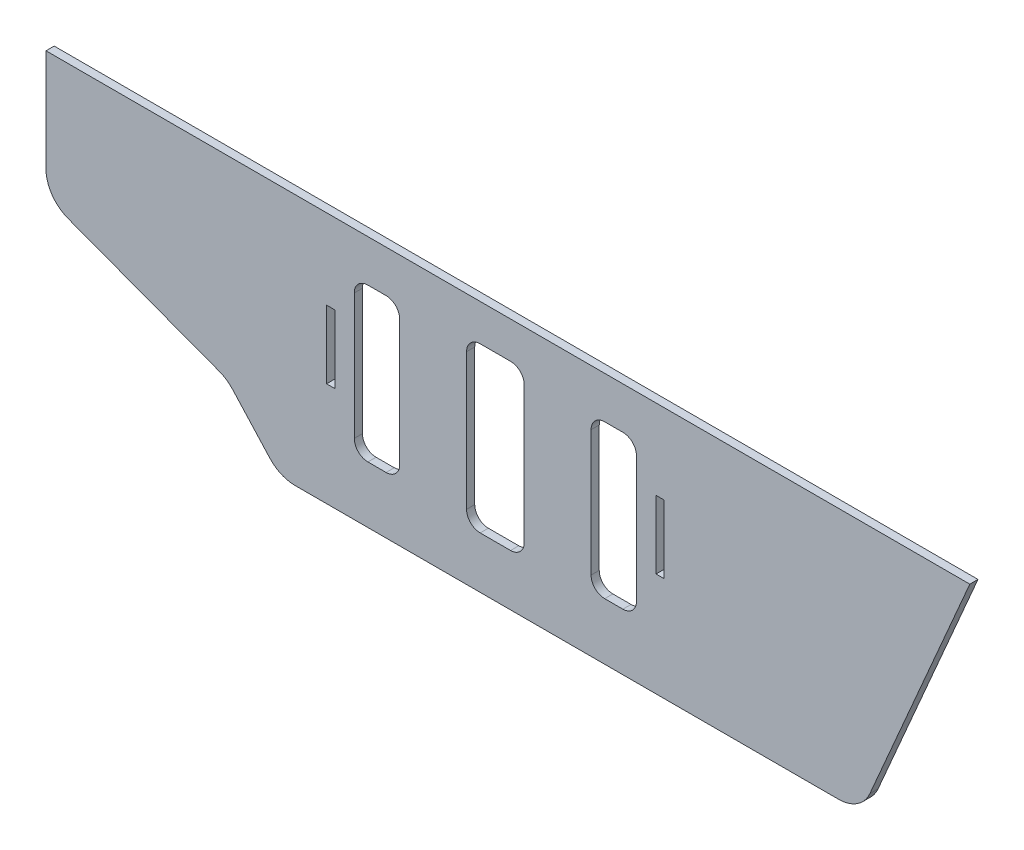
ISO-10303-21;
HEADER;
FILE_DESCRIPTION(('STEP AP214'),'2;1');
FILE_NAME('part.step','',(''),(''),'','','');
FILE_SCHEMA(('AUTOMOTIVE_DESIGN { 1 0 10303 214 1 1 1 1 }'));
ENDSEC;
DATA;
#1=APPLICATION_CONTEXT('core data for automotive mechanical design processes');
#2=APPLICATION_PROTOCOL_DEFINITION('international standard','automotive_design',2000,#1);
#3=PRODUCT_CONTEXT('',#1,'mechanical');
#4=PRODUCT('Part','Part','',(#3));
#5=PRODUCT_RELATED_PRODUCT_CATEGORY('part','',(#4));
#6=PRODUCT_DEFINITION_FORMATION('','',#4);
#7=PRODUCT_DEFINITION_CONTEXT('part definition',#1,'design');
#8=PRODUCT_DEFINITION('design','',#6,#7);
#9=PRODUCT_DEFINITION_SHAPE('','',#8);
#10=(LENGTH_UNIT() NAMED_UNIT(*) SI_UNIT(.MILLI.,.METRE.));
#11=(NAMED_UNIT(*) PLANE_ANGLE_UNIT() SI_UNIT($,.RADIAN.));
#12=(NAMED_UNIT(*) SI_UNIT($,.STERADIAN.) SOLID_ANGLE_UNIT());
#13=UNCERTAINTY_MEASURE_WITH_UNIT(LENGTH_MEASURE(1.E-05),#10,'distance_accuracy_value','');
#14=(GEOMETRIC_REPRESENTATION_CONTEXT(3) GLOBAL_UNCERTAINTY_ASSIGNED_CONTEXT((#13)) GLOBAL_UNIT_ASSIGNED_CONTEXT((#10,
#11,#12)) REPRESENTATION_CONTEXT('',''));
#15=CARTESIAN_POINT('',(0.,0.,0.));
#16=DIRECTION('',(0.,0.,1.));
#17=DIRECTION('',(1.,0.,0.));
#18=AXIS2_PLACEMENT_3D('',#15,#16,#17);
#19=CARTESIAN_POINT('',(-108.88532555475,19.4699268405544,1.524));
#20=DIRECTION('',(0.,0.,-1.));
#21=DIRECTION('',(-1.,0.,0.));
#22=AXIS2_PLACEMENT_3D('',#19,#20,#21);
#23=PLANE('',#22);
#24=CARTESIAN_POINT('',(-7.69915683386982,4.71718740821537,1.524));
#25=DIRECTION('',(0.,0.,1.));
#26=DIRECTION('',(-1.,0.,0.));
#27=AXIS2_PLACEMENT_3D('',#24,#25,#26);
#28=CIRCLE('',#27,2.54);
#29=CARTESIAN_POINT('',(-7.69915683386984,2.17718740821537,1.524));
#30=VERTEX_POINT('',#29);
#31=CARTESIAN_POINT('',(-5.15915683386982,4.71718740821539,1.524));
#32=VERTEX_POINT('',#31);
#33=EDGE_CURVE('E370',#30,#32,#28,.T.);
#34=ORIENTED_EDGE('',*,*,#33,.F.);
#35=DIRECTION('',(1.,0.,0.));
#36=VECTOR('',#35,1.);
#37=CARTESIAN_POINT('',(-7.69915683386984,2.17718740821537,1.524));
#38=LINE('',#37,#36);
#39=CARTESIAN_POINT('',(-11.0925705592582,2.17718740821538,1.524));
#40=VERTEX_POINT('',#39);
#41=EDGE_CURVE('E386',#40,#30,#38,.T.);
#42=ORIENTED_EDGE('',*,*,#41,.F.);
#43=CARTESIAN_POINT('',(-11.0925705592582,4.71718740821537,1.524));
#44=DIRECTION('',(0.,0.,1.));
#45=DIRECTION('',(-1.,0.,0.));
#46=AXIS2_PLACEMENT_3D('',#43,#44,#45);
#47=CIRCLE('',#46,2.54);
#48=CARTESIAN_POINT('',(-13.6325705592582,4.71718740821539,1.524));
#49=VERTEX_POINT('',#48);
#50=EDGE_CURVE('E383',#49,#40,#47,.T.);
#51=ORIENTED_EDGE('',*,*,#50,.F.);
#52=DIRECTION('',(0.,-1.,0.));
#53=VECTOR('',#52,1.);
#54=CARTESIAN_POINT('',(-13.6325705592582,28.1845217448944,1.524));
#55=LINE('',#54,#53);
#56=CARTESIAN_POINT('',(-13.6325705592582,28.1845217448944,1.524));
#57=VERTEX_POINT('',#56);
#58=EDGE_CURVE('E381',#57,#49,#55,.T.);
#59=ORIENTED_EDGE('',*,*,#58,.F.);
#60=CARTESIAN_POINT('',(-11.0925705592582,28.1845217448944,1.524));
#61=DIRECTION('',(0.,0.,1.));
#62=DIRECTION('',(1.,0.,0.));
#63=AXIS2_PLACEMENT_3D('',#60,#61,#62);
#64=CIRCLE('',#63,2.54);
#65=CARTESIAN_POINT('',(-11.0925705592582,30.7245217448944,1.524));
#66=VERTEX_POINT('',#65);
#67=EDGE_CURVE('E379',#66,#57,#64,.T.);
#68=ORIENTED_EDGE('',*,*,#67,.F.);
#69=DIRECTION('',(-1.,0.,0.));
#70=VECTOR('',#69,1.);
#71=CARTESIAN_POINT('',(-7.69915683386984,30.7245217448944,1.524));
#72=LINE('',#71,#70);
#73=CARTESIAN_POINT('',(-7.69915683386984,30.7245217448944,1.524));
#74=VERTEX_POINT('',#73);
#75=EDGE_CURVE('E377',#74,#66,#72,.T.);
#76=ORIENTED_EDGE('',*,*,#75,.F.);
#77=CARTESIAN_POINT('',(-7.69915683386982,28.1845217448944,1.524));
#78=DIRECTION('',(0.,0.,1.));
#79=DIRECTION('',(-1.,0.,0.));
#80=AXIS2_PLACEMENT_3D('',#77,#78,#79);
#81=CIRCLE('',#80,2.54);
#82=CARTESIAN_POINT('',(-5.15915683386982,28.1845217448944,1.524));
#83=VERTEX_POINT('',#82);
#84=EDGE_CURVE('E375',#83,#74,#81,.T.);
#85=ORIENTED_EDGE('',*,*,#84,.F.);
#86=DIRECTION('',(0.,1.,0.));
#87=VECTOR('',#86,1.);
#88=CARTESIAN_POINT('',(-5.15915683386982,28.1845217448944,1.524));
#89=LINE('',#88,#87);
#90=EDGE_CURVE('E372',#32,#83,#89,.T.);
#91=ORIENTED_EDGE('',*,*,#90,.F.);
#92=EDGE_LOOP('',(#34,#42,#51,#59,#68,#76,#85,#91));
#93=FACE_BOUND('',#92,.T.);
#94=DIRECTION('',(0.,-1.,0.));
#95=VECTOR('',#94,1.);
#96=CARTESIAN_POINT('',(-1.524,10.9420975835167,1.524));
#97=LINE('',#96,#95);
#98=CARTESIAN_POINT('',(-1.524,23.6420975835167,1.524));
#99=VERTEX_POINT('',#98);
#100=CARTESIAN_POINT('',(-1.524,10.9420975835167,1.524));
#101=VERTEX_POINT('',#100);
#102=EDGE_CURVE('E488',#99,#101,#97,.T.);
#103=ORIENTED_EDGE('',*,*,#102,.F.);
#104=DIRECTION('',(-1.,0.,0.));
#105=VECTOR('',#104,1.);
#106=CARTESIAN_POINT('',(-1.524,23.6420975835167,1.524));
#107=LINE('',#106,#105);
#108=CARTESIAN_POINT('',(0.,23.6420975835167,1.524));
#109=VERTEX_POINT('',#108);
#110=EDGE_CURVE('E496',#109,#99,#107,.T.);
#111=ORIENTED_EDGE('',*,*,#110,.F.);
#112=DIRECTION('',(0.,1.,0.));
#113=VECTOR('',#112,1.);
#114=CARTESIAN_POINT('',(0.,10.9420975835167,1.524));
#115=LINE('',#114,#113);
#116=CARTESIAN_POINT('',(0.,10.9420975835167,1.524));
#117=VERTEX_POINT('',#116);
#118=EDGE_CURVE('E493',#117,#109,#115,.T.);
#119=ORIENTED_EDGE('',*,*,#118,.F.);
#120=DIRECTION('',(1.,0.,0.));
#121=VECTOR('',#120,1.);
#122=CARTESIAN_POINT('',(-1.524,10.9420975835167,1.524));
#123=LINE('',#122,#121);
#124=EDGE_CURVE('E490',#101,#117,#123,.T.);
#125=ORIENTED_EDGE('',*,*,#124,.F.);
#126=EDGE_LOOP('',(#103,#111,#119,#125));
#127=FACE_BOUND('',#126,.T.);
#128=DIRECTION('',(0.,-1.,0.));
#129=VECTOR('',#128,1.);
#130=CARTESIAN_POINT('',(-115.23532555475,38.5530338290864,1.524));
#131=LINE('',#130,#129);
#132=CARTESIAN_POINT('',(-115.23532555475,38.5530338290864,1.524));
#133=VERTEX_POINT('',#132);
#134=CARTESIAN_POINT('',(-115.23532555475,19.4699268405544,1.524));
#135=VERTEX_POINT('',#134);
#136=EDGE_CURVE('E550',#133,#135,#131,.T.);
#137=ORIENTED_EDGE('',*,*,#136,.T.);
#138=CARTESIAN_POINT('',(-108.88532555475,19.4699268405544,1.524));
#139=DIRECTION('',(0.,0.,1.));
#140=DIRECTION('',(-1.,0.,0.));
#141=AXIS2_PLACEMENT_3D('',#138,#139,#140);
#142=CIRCLE('',#141,6.35);
#143=CARTESIAN_POINT('',(-111.115025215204,13.5242612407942,1.524));
#144=VERTEX_POINT('',#143);
#145=EDGE_CURVE('E553',#135,#144,#142,.T.);
#146=ORIENTED_EDGE('',*,*,#145,.T.);
#147=DIRECTION('',(0.936325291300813,-0.351133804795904,0.));
#148=VECTOR('',#147,1.);
#149=CARTESIAN_POINT('',(-111.115025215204,13.5242612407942,1.524));
#150=LINE('',#149,#148);
#151=CARTESIAN_POINT('',(-82.9262828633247,2.95312699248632,1.524));
#152=VERTEX_POINT('',#151);
#153=EDGE_CURVE('E556',#144,#152,#150,.T.);
#154=ORIENTED_EDGE('',*,*,#153,.T.);
#155=CARTESIAN_POINT('',(-85.1559825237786,-2.99253860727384,1.524));
#156=DIRECTION('',(0.,0.,-1.));
#157=DIRECTION('',(-1.,0.,0.));
#158=AXIS2_PLACEMENT_3D('',#155,#156,#157);
#159=CIRCLE('',#158,6.35);
#160=CARTESIAN_POINT('',(-80.4611769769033,1.28312518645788,1.524));
#161=VERTEX_POINT('',#160);
#162=EDGE_CURVE('E558',#152,#161,#159,.T.);
#163=ORIENTED_EDGE('',*,*,#162,.T.);
#164=DIRECTION('',(0.673332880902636,-0.739339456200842,0.));
#165=VECTOR('',#164,1.);
#166=CARTESIAN_POINT('',(-80.4611769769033,1.28312518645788,1.524));
#167=LINE('',#166,#165);
#168=CARTESIAN_POINT('',(-73.5187677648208,-6.33984585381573,1.524));
#169=VERTEX_POINT('',#168);
#170=EDGE_CURVE('E560',#161,#169,#167,.T.);
#171=ORIENTED_EDGE('',*,*,#170,.T.);
#172=CARTESIAN_POINT('',(-68.8239622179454,-2.06418206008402,1.524));
#173=DIRECTION('',(0.,0.,1.));
#174=DIRECTION('',(1.,0.,0.));
#175=AXIS2_PLACEMENT_3D('',#172,#173,#174);
#176=CIRCLE('',#175,6.35);
#177=CARTESIAN_POINT('',(-68.8239622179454,-8.41418206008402,1.524));
#178=VERTEX_POINT('',#177);
#179=EDGE_CURVE('E562',#169,#178,#176,.T.);
#180=ORIENTED_EDGE('',*,*,#179,.T.);
#181=DIRECTION('',(1.,0.,0.));
#182=VECTOR('',#181,1.);
#183=CARTESIAN_POINT('',(-68.8239622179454,-8.41418206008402,1.524));
#184=LINE('',#183,#182);
#185=CARTESIAN_POINT('',(32.5063760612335,-8.41418206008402,1.524));
#186=VERTEX_POINT('',#185);
#187=EDGE_CURVE('E564',#178,#186,#184,.T.);
#188=ORIENTED_EDGE('',*,*,#187,.T.);
#189=CARTESIAN_POINT('',(32.5063760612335,-2.06418206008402,1.524));
#190=DIRECTION('',(0.,0.,1.));
#191=DIRECTION('',(-1.,0.,0.));
#192=AXIS2_PLACEMENT_3D('',#189,#190,#191);
#193=CIRCLE('',#192,6.35);
#194=CARTESIAN_POINT('',(38.3357665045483,-4.58225812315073,1.524));
#195=VERTEX_POINT('',#194);
#196=EDGE_CURVE('E566',#186,#195,#193,.T.);
#197=ORIENTED_EDGE('',*,*,#196,.T.);
#198=DIRECTION('',(0.396547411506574,0.918014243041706,0.));
#199=VECTOR('',#198,1.);
#200=CARTESIAN_POINT('',(56.9685802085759,38.5530338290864,1.524));
#201=LINE('',#200,#199);
#202=CARTESIAN_POINT('',(56.9685802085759,38.5530338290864,1.524));
#203=VERTEX_POINT('',#202);
#204=EDGE_CURVE('E568',#195,#203,#201,.T.);
#205=ORIENTED_EDGE('',*,*,#204,.T.);
#206=DIRECTION('',(-1.,0.,0.));
#207=VECTOR('',#206,1.);
#208=CARTESIAN_POINT('',(-115.23532555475,38.5530338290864,1.524));
#209=LINE('',#208,#207);
#210=EDGE_CURVE('E570',#203,#133,#209,.T.);
#211=ORIENTED_EDGE('',*,*,#210,.T.);
#212=EDGE_LOOP('',(#137,#146,#154,#163,#171,#180,#188,#197,#205,#211));
#213=FACE_BOUND('',#212,.T.);
#214=DIRECTION('',(0.,-1.,0.));
#215=VECTOR('',#214,1.);
#216=CARTESIAN_POINT('',(-62.9329472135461,10.9420975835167,1.524));
#217=LINE('',#216,#215);
#218=CARTESIAN_POINT('',(-62.9329472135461,23.6420975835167,1.524));
#219=VERTEX_POINT('',#218);
#220=CARTESIAN_POINT('',(-62.9329472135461,10.9420975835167,1.524));
#221=VERTEX_POINT('',#220);
#222=EDGE_CURVE('E519',#219,#221,#217,.T.);
#223=ORIENTED_EDGE('',*,*,#222,.F.);
#224=DIRECTION('',(-1.,0.,0.));
#225=VECTOR('',#224,1.);
#226=CARTESIAN_POINT('',(-62.9329472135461,23.6420975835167,1.524));
#227=LINE('',#226,#225);
#228=CARTESIAN_POINT('',(-61.4089472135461,23.6420975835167,1.524));
#229=VERTEX_POINT('',#228);
#230=EDGE_CURVE('E527',#229,#219,#227,.T.);
#231=ORIENTED_EDGE('',*,*,#230,.F.);
#232=DIRECTION('',(0.,1.,0.));
#233=VECTOR('',#232,1.);
#234=CARTESIAN_POINT('',(-61.4089472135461,10.9420975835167,1.524));
#235=LINE('',#234,#233);
#236=CARTESIAN_POINT('',(-61.4089472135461,10.9420975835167,1.524));
#237=VERTEX_POINT('',#236);
#238=EDGE_CURVE('E524',#237,#229,#235,.T.);
#239=ORIENTED_EDGE('',*,*,#238,.F.);
#240=DIRECTION('',(1.,0.,0.));
#241=VECTOR('',#240,1.);
#242=CARTESIAN_POINT('',(-62.9329472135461,10.9420975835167,1.524));
#243=LINE('',#242,#241);
#244=EDGE_CURVE('E521',#221,#237,#243,.T.);
#245=ORIENTED_EDGE('',*,*,#244,.F.);
#246=EDGE_LOOP('',(#223,#231,#239,#245));
#247=FACE_BOUND('',#246,.T.);
#248=CARTESIAN_POINT('',(-55.2337903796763,28.1845217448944,1.524));
#249=DIRECTION('',(0.,0.,1.));
#250=DIRECTION('',(1.,0.,0.));
#251=AXIS2_PLACEMENT_3D('',#248,#249,#250);
#252=CIRCLE('',#251,2.54);
#253=CARTESIAN_POINT('',(-55.2337903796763,30.7245217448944,1.524));
#254=VERTEX_POINT('',#253);
#255=CARTESIAN_POINT('',(-57.7737903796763,28.1845217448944,1.524));
#256=VERTEX_POINT('',#255);
#257=EDGE_CURVE('E429',#254,#256,#252,.T.);
#258=ORIENTED_EDGE('',*,*,#257,.F.);
#259=DIRECTION('',(-1.,0.,0.));
#260=VECTOR('',#259,1.);
#261=CARTESIAN_POINT('',(-55.2337903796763,30.7245217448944,1.524));
#262=LINE('',#261,#260);
#263=CARTESIAN_POINT('',(-51.8403766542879,30.7245217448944,1.524));
#264=VERTEX_POINT('',#263);
#265=EDGE_CURVE('E445',#264,#254,#262,.T.);
#266=ORIENTED_EDGE('',*,*,#265,.F.);
#267=CARTESIAN_POINT('',(-51.8403766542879,28.1845217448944,1.524));
#268=DIRECTION('',(0.,0.,1.));
#269=DIRECTION('',(-1.,0.,0.));
#270=AXIS2_PLACEMENT_3D('',#267,#268,#269);
#271=CIRCLE('',#270,2.54);
#272=CARTESIAN_POINT('',(-49.3003766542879,28.1845217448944,1.524));
#273=VERTEX_POINT('',#272);
#274=EDGE_CURVE('E442',#273,#264,#271,.T.);
#275=ORIENTED_EDGE('',*,*,#274,.F.);
#276=DIRECTION('',(0.,1.,0.));
#277=VECTOR('',#276,1.);
#278=CARTESIAN_POINT('',(-49.3003766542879,28.1845217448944,1.524));
#279=LINE('',#278,#277);
#280=CARTESIAN_POINT('',(-49.3003766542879,4.71718740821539,1.524));
#281=VERTEX_POINT('',#280);
#282=EDGE_CURVE('E440',#281,#273,#279,.T.);
#283=ORIENTED_EDGE('',*,*,#282,.F.);
#284=CARTESIAN_POINT('',(-51.8403766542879,4.71718740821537,1.524));
#285=DIRECTION('',(0.,0.,1.));
#286=DIRECTION('',(1.,0.,0.));
#287=AXIS2_PLACEMENT_3D('',#284,#285,#286);
#288=CIRCLE('',#287,2.54);
#289=CARTESIAN_POINT('',(-51.8403766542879,2.17718740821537,1.524));
#290=VERTEX_POINT('',#289);
#291=EDGE_CURVE('E438',#290,#281,#288,.T.);
#292=ORIENTED_EDGE('',*,*,#291,.F.);
#293=DIRECTION('',(1.,0.,0.));
#294=VECTOR('',#293,1.);
#295=CARTESIAN_POINT('',(-55.2337903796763,2.17718740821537,1.524));
#296=LINE('',#295,#294);
#297=CARTESIAN_POINT('',(-55.2337903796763,2.17718740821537,1.524));
#298=VERTEX_POINT('',#297);
#299=EDGE_CURVE('E436',#298,#290,#296,.T.);
#300=ORIENTED_EDGE('',*,*,#299,.F.);
#301=CARTESIAN_POINT('',(-55.2337903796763,4.71718740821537,1.524));
#302=DIRECTION('',(0.,0.,1.));
#303=DIRECTION('',(1.,0.,0.));
#304=AXIS2_PLACEMENT_3D('',#301,#302,#303);
#305=CIRCLE('',#304,2.54);
#306=CARTESIAN_POINT('',(-57.7737903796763,4.71718740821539,1.524));
#307=VERTEX_POINT('',#306);
#308=EDGE_CURVE('E434',#307,#298,#305,.T.);
#309=ORIENTED_EDGE('',*,*,#308,.F.);
#310=DIRECTION('',(0.,-1.,0.));
#311=VECTOR('',#310,1.);
#312=CARTESIAN_POINT('',(-57.7737903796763,28.1845217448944,1.524));
#313=LINE('',#312,#311);
#314=EDGE_CURVE('E431',#256,#307,#313,.T.);
#315=ORIENTED_EDGE('',*,*,#314,.F.);
#316=EDGE_LOOP('',(#258,#266,#275,#283,#292,#300,#309,#315));
#317=FACE_BOUND('',#316,.T.);
#318=CARTESIAN_POINT('',(-34.3028356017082,3.72575810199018,1.524));
#319=DIRECTION('',(0.,0.,1.));
#320=DIRECTION('',(-1.,0.,0.));
#321=AXIS2_PLACEMENT_3D('',#318,#319,#320);
#322=CIRCLE('',#321,2.54);
#323=CARTESIAN_POINT('',(-36.8428356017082,3.72575810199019,1.524));
#324=VERTEX_POINT('',#323);
#325=CARTESIAN_POINT('',(-34.3028356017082,1.18575810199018,1.524));
#326=VERTEX_POINT('',#325);
#327=EDGE_CURVE('E305',#324,#326,#322,.T.);
#328=ORIENTED_EDGE('',*,*,#327,.F.);
#329=DIRECTION('',(0.,-1.,0.));
#330=VECTOR('',#329,1.);
#331=CARTESIAN_POINT('',(-36.8428356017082,3.72575810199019,1.524));
#332=LINE('',#331,#330);
#333=CARTESIAN_POINT('',(-36.8428356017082,29.1759510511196,1.524));
#334=VERTEX_POINT('',#333);
#335=EDGE_CURVE('E338',#334,#324,#332,.T.);
#336=ORIENTED_EDGE('',*,*,#335,.F.);
#337=CARTESIAN_POINT('',(-34.3028356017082,29.1759510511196,1.524));
#338=DIRECTION('',(0.,0.,1.));
#339=DIRECTION('',(-1.,0.,0.));
#340=AXIS2_PLACEMENT_3D('',#337,#338,#339);
#341=CIRCLE('',#340,2.54);
#342=CARTESIAN_POINT('',(-34.3028356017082,31.7159510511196,1.524));
#343=VERTEX_POINT('',#342);
#344=EDGE_CURVE('E336',#343,#334,#341,.T.);
#345=ORIENTED_EDGE('',*,*,#344,.F.);
#346=DIRECTION('',(-1.,0.,0.));
#347=VECTOR('',#346,1.);
#348=CARTESIAN_POINT('',(-34.3028356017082,31.7159510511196,1.524));
#349=LINE('',#348,#347);
#350=CARTESIAN_POINT('',(-28.630111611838,31.7159510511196,1.524));
#351=VERTEX_POINT('',#350);
#352=EDGE_CURVE('E334',#351,#343,#349,.T.);
#353=ORIENTED_EDGE('',*,*,#352,.F.);
#354=CARTESIAN_POINT('',(-28.6301116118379,29.1759510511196,1.524));
#355=DIRECTION('',(0.,0.,1.));
#356=DIRECTION('',(-1.,0.,0.));
#357=AXIS2_PLACEMENT_3D('',#354,#355,#356);
#358=CIRCLE('',#357,2.54);
#359=CARTESIAN_POINT('',(-26.0901116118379,29.1759510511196,1.524));
#360=VERTEX_POINT('',#359);
#361=EDGE_CURVE('E332',#360,#351,#358,.T.);
#362=ORIENTED_EDGE('',*,*,#361,.F.);
#363=DIRECTION('',(0.,1.,0.));
#364=VECTOR('',#363,1.);
#365=CARTESIAN_POINT('',(-26.0901116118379,3.72575810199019,1.524));
#366=LINE('',#365,#364);
#367=CARTESIAN_POINT('',(-26.0901116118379,3.72575810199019,1.524));
#368=VERTEX_POINT('',#367);
#369=EDGE_CURVE('E328',#368,#360,#366,.T.);
#370=ORIENTED_EDGE('',*,*,#369,.F.);
#371=CARTESIAN_POINT('',(-28.6301116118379,3.72575810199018,1.524));
#372=DIRECTION('',(0.,0.,1.));
#373=DIRECTION('',(1.,0.,0.));
#374=AXIS2_PLACEMENT_3D('',#371,#372,#373);
#375=CIRCLE('',#374,2.54);
#376=CARTESIAN_POINT('',(-28.630111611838,1.18575810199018,1.524));
#377=VERTEX_POINT('',#376);
#378=EDGE_CURVE('E326',#377,#368,#375,.T.);
#379=ORIENTED_EDGE('',*,*,#378,.F.);
#380=DIRECTION('',(1.,0.,0.));
#381=VECTOR('',#380,1.);
#382=CARTESIAN_POINT('',(-34.3028356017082,1.18575810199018,1.524));
#383=LINE('',#382,#381);
#384=EDGE_CURVE('E313',#326,#377,#383,.T.);
#385=ORIENTED_EDGE('',*,*,#384,.F.);
#386=EDGE_LOOP('',(#328,#336,#345,#353,#362,#370,#379,#385));
#387=FACE_BOUND('',#386,.T.);
#388=ADVANCED_FACE('F36',(#93,#127,#213,#247,#317,#387),#23,.F.);
#389=CARTESIAN_POINT('',(-108.88532555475,19.4699268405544,0.));
#390=DIRECTION('',(0.,0.,-1.));
#391=DIRECTION('',(-1.,0.,0.));
#392=AXIS2_PLACEMENT_3D('',#389,#390,#391);
#393=PLANE('',#392);
#394=DIRECTION('',(1.,0.,0.));
#395=VECTOR('',#394,1.);
#396=CARTESIAN_POINT('',(-7.69915683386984,2.17718740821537,0.));
#397=LINE('',#396,#395);
#398=CARTESIAN_POINT('',(-11.0925705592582,2.17718740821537,0.));
#399=VERTEX_POINT('',#398);
#400=CARTESIAN_POINT('',(-7.69915683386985,2.17718740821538,0.));
#401=VERTEX_POINT('',#400);
#402=EDGE_CURVE('E373',#399,#401,#397,.T.);
#403=ORIENTED_EDGE('',*,*,#402,.T.);
#404=CARTESIAN_POINT('',(-7.69915683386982,4.71718740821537,0.));
#405=DIRECTION('',(0.,0.,1.));
#406=DIRECTION('',(-1.,0.,0.));
#407=AXIS2_PLACEMENT_3D('',#404,#405,#406);
#408=CIRCLE('',#407,2.54);
#409=CARTESIAN_POINT('',(-5.15915683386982,4.71718740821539,0.));
#410=VERTEX_POINT('',#409);
#411=EDGE_CURVE('E321',#401,#410,#408,.T.);
#412=ORIENTED_EDGE('',*,*,#411,.T.);
#413=DIRECTION('',(0.,1.,0.));
#414=VECTOR('',#413,1.);
#415=CARTESIAN_POINT('',(-5.15915683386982,28.1845217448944,0.));
#416=LINE('',#415,#414);
#417=CARTESIAN_POINT('',(-5.15915683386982,28.1845217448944,0.));
#418=VERTEX_POINT('',#417);
#419=EDGE_CURVE('E391',#410,#418,#416,.T.);
#420=ORIENTED_EDGE('',*,*,#419,.T.);
#421=CARTESIAN_POINT('',(-7.69915683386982,28.1845217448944,0.));
#422=DIRECTION('',(0.,0.,1.));
#423=DIRECTION('',(-1.,0.,0.));
#424=AXIS2_PLACEMENT_3D('',#421,#422,#423);
#425=CIRCLE('',#424,2.54);
#426=CARTESIAN_POINT('',(-7.69915683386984,30.7245217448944,0.));
#427=VERTEX_POINT('',#426);
#428=EDGE_CURVE('E394',#418,#427,#425,.T.);
#429=ORIENTED_EDGE('',*,*,#428,.T.);
#430=DIRECTION('',(-1.,0.,0.));
#431=VECTOR('',#430,1.);
#432=CARTESIAN_POINT('',(-7.69915683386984,30.7245217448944,0.));
#433=LINE('',#432,#431);
#434=CARTESIAN_POINT('',(-11.0925705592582,30.7245217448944,0.));
#435=VERTEX_POINT('',#434);
#436=EDGE_CURVE('E397',#427,#435,#433,.T.);
#437=ORIENTED_EDGE('',*,*,#436,.T.);
#438=CARTESIAN_POINT('',(-11.0925705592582,28.1845217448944,0.));
#439=DIRECTION('',(0.,0.,1.));
#440=DIRECTION('',(1.,0.,0.));
#441=AXIS2_PLACEMENT_3D('',#438,#439,#440);
#442=CIRCLE('',#441,2.54);
#443=CARTESIAN_POINT('',(-13.6325705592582,28.1845217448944,0.));
#444=VERTEX_POINT('',#443);
#445=EDGE_CURVE('E400',#435,#444,#442,.T.);
#446=ORIENTED_EDGE('',*,*,#445,.T.);
#447=DIRECTION('',(0.,-1.,0.));
#448=VECTOR('',#447,1.);
#449=CARTESIAN_POINT('',(-13.6325705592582,28.1845217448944,0.));
#450=LINE('',#449,#448);
#451=CARTESIAN_POINT('',(-13.6325705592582,4.71718740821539,0.));
#452=VERTEX_POINT('',#451);
#453=EDGE_CURVE('E403',#444,#452,#450,.T.);
#454=ORIENTED_EDGE('',*,*,#453,.T.);
#455=CARTESIAN_POINT('',(-11.0925705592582,4.71718740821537,0.));
#456=DIRECTION('',(0.,0.,1.));
#457=DIRECTION('',(-1.,0.,0.));
#458=AXIS2_PLACEMENT_3D('',#455,#456,#457);
#459=CIRCLE('',#458,2.54);
#460=EDGE_CURVE('E406',#452,#399,#459,.T.);
#461=ORIENTED_EDGE('',*,*,#460,.T.);
#462=EDGE_LOOP('',(#403,#412,#420,#429,#437,#446,#454,#461));
#463=FACE_BOUND('',#462,.T.);
#464=DIRECTION('',(-1.,0.,0.));
#465=VECTOR('',#464,1.);
#466=CARTESIAN_POINT('',(-1.524,23.6420975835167,0.));
#467=LINE('',#466,#465);
#468=CARTESIAN_POINT('',(0.,23.6420975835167,0.));
#469=VERTEX_POINT('',#468);
#470=CARTESIAN_POINT('',(-1.524,23.6420975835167,0.));
#471=VERTEX_POINT('',#470);
#472=EDGE_CURVE('E491',#469,#471,#467,.T.);
#473=ORIENTED_EDGE('',*,*,#472,.T.);
#474=DIRECTION('',(0.,-1.,0.));
#475=VECTOR('',#474,1.);
#476=CARTESIAN_POINT('',(-1.524,10.9420975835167,0.));
#477=LINE('',#476,#475);
#478=CARTESIAN_POINT('',(-1.524,10.9420975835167,0.));
#479=VERTEX_POINT('',#478);
#480=EDGE_CURVE('E487',#471,#479,#477,.T.);
#481=ORIENTED_EDGE('',*,*,#480,.T.);
#482=DIRECTION('',(1.,0.,0.));
#483=VECTOR('',#482,1.);
#484=CARTESIAN_POINT('',(-1.524,10.9420975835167,0.));
#485=LINE('',#484,#483);
#486=CARTESIAN_POINT('',(0.,10.9420975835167,0.));
#487=VERTEX_POINT('',#486);
#488=EDGE_CURVE('E501',#479,#487,#485,.T.);
#489=ORIENTED_EDGE('',*,*,#488,.T.);
#490=DIRECTION('',(0.,1.,0.));
#491=VECTOR('',#490,1.);
#492=CARTESIAN_POINT('',(0.,10.9420975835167,0.));
#493=LINE('',#492,#491);
#494=EDGE_CURVE('E504',#487,#469,#493,.T.);
#495=ORIENTED_EDGE('',*,*,#494,.T.);
#496=EDGE_LOOP('',(#473,#481,#489,#495));
#497=FACE_BOUND('',#496,.T.);
#498=DIRECTION('',(0.,-1.,0.));
#499=VECTOR('',#498,1.);
#500=CARTESIAN_POINT('',(-115.23532555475,38.5530338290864,0.));
#501=LINE('',#500,#499);
#502=CARTESIAN_POINT('',(-115.23532555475,38.5530338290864,0.));
#503=VERTEX_POINT('',#502);
#504=CARTESIAN_POINT('',(-115.23532555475,19.4699268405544,0.));
#505=VERTEX_POINT('',#504);
#506=EDGE_CURVE('E549',#503,#505,#501,.T.);
#507=ORIENTED_EDGE('',*,*,#506,.F.);
#508=DIRECTION('',(-1.,0.,0.));
#509=VECTOR('',#508,1.);
#510=CARTESIAN_POINT('',(-115.23532555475,38.5530338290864,0.));
#511=LINE('',#510,#509);
#512=CARTESIAN_POINT('',(56.9685802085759,38.5530338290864,0.));
#513=VERTEX_POINT('',#512);
#514=EDGE_CURVE('E554',#513,#503,#511,.T.);
#515=ORIENTED_EDGE('',*,*,#514,.F.);
#516=DIRECTION('',(0.396547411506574,0.918014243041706,0.));
#517=VECTOR('',#516,1.);
#518=CARTESIAN_POINT('',(56.9685802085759,38.5530338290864,0.));
#519=LINE('',#518,#517);
#520=CARTESIAN_POINT('',(38.3357665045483,-4.58225812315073,0.));
#521=VERTEX_POINT('',#520);
#522=EDGE_CURVE('E589',#521,#513,#519,.T.);
#523=ORIENTED_EDGE('',*,*,#522,.F.);
#524=CARTESIAN_POINT('',(32.5063760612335,-2.06418206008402,0.));
#525=DIRECTION('',(0.,0.,1.));
#526=DIRECTION('',(-1.,0.,0.));
#527=AXIS2_PLACEMENT_3D('',#524,#525,#526);
#528=CIRCLE('',#527,6.35);
#529=CARTESIAN_POINT('',(32.5063760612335,-8.41418206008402,0.));
#530=VERTEX_POINT('',#529);
#531=EDGE_CURVE('E587',#530,#521,#528,.T.);
#532=ORIENTED_EDGE('',*,*,#531,.F.);
#533=DIRECTION('',(1.,0.,0.));
#534=VECTOR('',#533,1.);
#535=CARTESIAN_POINT('',(-68.8239622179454,-8.41418206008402,0.));
#536=LINE('',#535,#534);
#537=CARTESIAN_POINT('',(-68.8239622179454,-8.41418206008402,0.));
#538=VERTEX_POINT('',#537);
#539=EDGE_CURVE('E585',#538,#530,#536,.T.);
#540=ORIENTED_EDGE('',*,*,#539,.F.);
#541=CARTESIAN_POINT('',(-68.8239622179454,-2.06418206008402,0.));
#542=DIRECTION('',(0.,0.,1.));
#543=DIRECTION('',(1.,0.,0.));
#544=AXIS2_PLACEMENT_3D('',#541,#542,#543);
#545=CIRCLE('',#544,6.35);
#546=CARTESIAN_POINT('',(-73.5187677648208,-6.33984585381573,0.));
#547=VERTEX_POINT('',#546);
#548=EDGE_CURVE('E583',#547,#538,#545,.T.);
#549=ORIENTED_EDGE('',*,*,#548,.F.);
#550=DIRECTION('',(0.673332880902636,-0.739339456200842,0.));
#551=VECTOR('',#550,1.);
#552=CARTESIAN_POINT('',(-80.4611769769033,1.28312518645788,0.));
#553=LINE('',#552,#551);
#554=CARTESIAN_POINT('',(-80.4611769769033,1.28312518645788,0.));
#555=VERTEX_POINT('',#554);
#556=EDGE_CURVE('E581',#555,#547,#553,.T.);
#557=ORIENTED_EDGE('',*,*,#556,.F.);
#558=CARTESIAN_POINT('',(-85.1559825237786,-2.99253860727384,0.));
#559=DIRECTION('',(0.,0.,-1.));
#560=DIRECTION('',(-1.,0.,0.));
#561=AXIS2_PLACEMENT_3D('',#558,#559,#560);
#562=CIRCLE('',#561,6.35);
#563=CARTESIAN_POINT('',(-82.9262828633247,2.95312699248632,0.));
#564=VERTEX_POINT('',#563);
#565=EDGE_CURVE('E579',#564,#555,#562,.T.);
#566=ORIENTED_EDGE('',*,*,#565,.F.);
#567=DIRECTION('',(0.936325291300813,-0.351133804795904,0.));
#568=VECTOR('',#567,1.);
#569=CARTESIAN_POINT('',(-111.115025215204,13.5242612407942,0.));
#570=LINE('',#569,#568);
#571=CARTESIAN_POINT('',(-111.115025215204,13.5242612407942,0.));
#572=VERTEX_POINT('',#571);
#573=EDGE_CURVE('E577',#572,#564,#570,.T.);
#574=ORIENTED_EDGE('',*,*,#573,.F.);
#575=CARTESIAN_POINT('',(-108.88532555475,19.4699268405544,0.));
#576=DIRECTION('',(0.,0.,1.));
#577=DIRECTION('',(-1.,0.,0.));
#578=AXIS2_PLACEMENT_3D('',#575,#576,#577);
#579=CIRCLE('',#578,6.35);
#580=EDGE_CURVE('E575',#505,#572,#579,.T.);
#581=ORIENTED_EDGE('',*,*,#580,.F.);
#582=EDGE_LOOP('',(#507,#515,#523,#532,#540,#549,#557,#566,#574,#581));
#583=FACE_BOUND('',#582,.T.);
#584=DIRECTION('',(-1.,0.,0.));
#585=VECTOR('',#584,1.);
#586=CARTESIAN_POINT('',(-62.9329472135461,23.6420975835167,0.));
#587=LINE('',#586,#585);
#588=CARTESIAN_POINT('',(-61.4089472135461,23.6420975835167,0.));
#589=VERTEX_POINT('',#588);
#590=CARTESIAN_POINT('',(-62.9329472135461,23.6420975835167,0.));
#591=VERTEX_POINT('',#590);
#592=EDGE_CURVE('E522',#589,#591,#587,.T.);
#593=ORIENTED_EDGE('',*,*,#592,.T.);
#594=DIRECTION('',(0.,-1.,0.));
#595=VECTOR('',#594,1.);
#596=CARTESIAN_POINT('',(-62.9329472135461,10.9420975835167,0.));
#597=LINE('',#596,#595);
#598=CARTESIAN_POINT('',(-62.9329472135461,10.9420975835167,0.));
#599=VERTEX_POINT('',#598);
#600=EDGE_CURVE('E518',#591,#599,#597,.T.);
#601=ORIENTED_EDGE('',*,*,#600,.T.);
#602=DIRECTION('',(1.,0.,0.));
#603=VECTOR('',#602,1.);
#604=CARTESIAN_POINT('',(-62.9329472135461,10.9420975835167,0.));
#605=LINE('',#604,#603);
#606=CARTESIAN_POINT('',(-61.4089472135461,10.9420975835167,0.));
#607=VERTEX_POINT('',#606);
#608=EDGE_CURVE('E532',#599,#607,#605,.T.);
#609=ORIENTED_EDGE('',*,*,#608,.T.);
#610=DIRECTION('',(0.,1.,0.));
#611=VECTOR('',#610,1.);
#612=CARTESIAN_POINT('',(-61.4089472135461,10.9420975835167,0.));
#613=LINE('',#612,#611);
#614=EDGE_CURVE('E535',#607,#589,#613,.T.);
#615=ORIENTED_EDGE('',*,*,#614,.T.);
#616=EDGE_LOOP('',(#593,#601,#609,#615));
#617=FACE_BOUND('',#616,.T.);
#618=DIRECTION('',(-1.,0.,0.));
#619=VECTOR('',#618,1.);
#620=CARTESIAN_POINT('',(-55.2337903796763,30.7245217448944,0.));
#621=LINE('',#620,#619);
#622=CARTESIAN_POINT('',(-51.8403766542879,30.7245217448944,0.));
#623=VERTEX_POINT('',#622);
#624=CARTESIAN_POINT('',(-55.2337903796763,30.7245217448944,0.));
#625=VERTEX_POINT('',#624);
#626=EDGE_CURVE('E432',#623,#625,#621,.T.);
#627=ORIENTED_EDGE('',*,*,#626,.T.);
#628=CARTESIAN_POINT('',(-55.2337903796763,28.1845217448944,0.));
#629=DIRECTION('',(0.,0.,1.));
#630=DIRECTION('',(1.,0.,0.));
#631=AXIS2_PLACEMENT_3D('',#628,#629,#630);
#632=CIRCLE('',#631,2.54);
#633=CARTESIAN_POINT('',(-57.7737903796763,28.1845217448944,0.));
#634=VERTEX_POINT('',#633);
#635=EDGE_CURVE('E428',#625,#634,#632,.T.);
#636=ORIENTED_EDGE('',*,*,#635,.T.);
#637=DIRECTION('',(0.,-1.,0.));
#638=VECTOR('',#637,1.);
#639=CARTESIAN_POINT('',(-57.7737903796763,28.1845217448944,0.));
#640=LINE('',#639,#638);
#641=CARTESIAN_POINT('',(-57.7737903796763,4.71718740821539,0.));
#642=VERTEX_POINT('',#641);
#643=EDGE_CURVE('E450',#634,#642,#640,.T.);
#644=ORIENTED_EDGE('',*,*,#643,.T.);
#645=CARTESIAN_POINT('',(-55.2337903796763,4.71718740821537,0.));
#646=DIRECTION('',(0.,0.,1.));
#647=DIRECTION('',(1.,0.,0.));
#648=AXIS2_PLACEMENT_3D('',#645,#646,#647);
#649=CIRCLE('',#648,2.54);
#650=CARTESIAN_POINT('',(-55.2337903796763,2.17718740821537,0.));
#651=VERTEX_POINT('',#650);
#652=EDGE_CURVE('E453',#642,#651,#649,.T.);
#653=ORIENTED_EDGE('',*,*,#652,.T.);
#654=DIRECTION('',(1.,0.,0.));
#655=VECTOR('',#654,1.);
#656=CARTESIAN_POINT('',(-55.2337903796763,2.17718740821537,0.));
#657=LINE('',#656,#655);
#658=CARTESIAN_POINT('',(-51.8403766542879,2.17718740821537,0.));
#659=VERTEX_POINT('',#658);
#660=EDGE_CURVE('E456',#651,#659,#657,.T.);
#661=ORIENTED_EDGE('',*,*,#660,.T.);
#662=CARTESIAN_POINT('',(-51.8403766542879,4.71718740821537,0.));
#663=DIRECTION('',(0.,0.,1.));
#664=DIRECTION('',(1.,0.,0.));
#665=AXIS2_PLACEMENT_3D('',#662,#663,#664);
#666=CIRCLE('',#665,2.54);
#667=CARTESIAN_POINT('',(-49.3003766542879,4.71718740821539,0.));
#668=VERTEX_POINT('',#667);
#669=EDGE_CURVE('E459',#659,#668,#666,.T.);
#670=ORIENTED_EDGE('',*,*,#669,.T.);
#671=DIRECTION('',(0.,1.,0.));
#672=VECTOR('',#671,1.);
#673=CARTESIAN_POINT('',(-49.3003766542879,28.1845217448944,0.));
#674=LINE('',#673,#672);
#675=CARTESIAN_POINT('',(-49.3003766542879,28.1845217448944,0.));
#676=VERTEX_POINT('',#675);
#677=EDGE_CURVE('E462',#668,#676,#674,.T.);
#678=ORIENTED_EDGE('',*,*,#677,.T.);
#679=CARTESIAN_POINT('',(-51.8403766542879,28.1845217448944,0.));
#680=DIRECTION('',(0.,0.,1.));
#681=DIRECTION('',(-1.,0.,0.));
#682=AXIS2_PLACEMENT_3D('',#679,#680,#681);
#683=CIRCLE('',#682,2.54);
#684=EDGE_CURVE('E465',#676,#623,#683,.T.);
#685=ORIENTED_EDGE('',*,*,#684,.T.);
#686=EDGE_LOOP('',(#627,#636,#644,#653,#661,#670,#678,#685));
#687=FACE_BOUND('',#686,.T.);
#688=DIRECTION('',(0.,-1.,0.));
#689=VECTOR('',#688,1.);
#690=CARTESIAN_POINT('',(-36.8428356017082,3.72575810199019,0.));
#691=LINE('',#690,#689);
#692=CARTESIAN_POINT('',(-36.8428356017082,29.1759510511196,0.));
#693=VERTEX_POINT('',#692);
#694=CARTESIAN_POINT('',(-36.8428356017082,3.7257581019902,0.));
#695=VERTEX_POINT('',#694);
#696=EDGE_CURVE('E314',#693,#695,#691,.T.);
#697=ORIENTED_EDGE('',*,*,#696,.T.);
#698=CARTESIAN_POINT('',(-34.3028356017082,3.72575810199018,0.));
#699=DIRECTION('',(0.,0.,1.));
#700=DIRECTION('',(-1.,0.,0.));
#701=AXIS2_PLACEMENT_3D('',#698,#699,#700);
#702=CIRCLE('',#701,2.54);
#703=CARTESIAN_POINT('',(-34.3028356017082,1.18575810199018,0.));
#704=VERTEX_POINT('',#703);
#705=EDGE_CURVE('E59',#695,#704,#702,.T.);
#706=ORIENTED_EDGE('',*,*,#705,.T.);
#707=DIRECTION('',(1.,0.,0.));
#708=VECTOR('',#707,1.);
#709=CARTESIAN_POINT('',(-34.3028356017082,1.18575810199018,0.));
#710=LINE('',#709,#708);
#711=CARTESIAN_POINT('',(-28.630111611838,1.18575810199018,0.));
#712=VERTEX_POINT('',#711);
#713=EDGE_CURVE('E320',#704,#712,#710,.T.);
#714=ORIENTED_EDGE('',*,*,#713,.T.);
#715=CARTESIAN_POINT('',(-28.6301116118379,3.72575810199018,0.));
#716=DIRECTION('',(0.,0.,1.));
#717=DIRECTION('',(1.,0.,0.));
#718=AXIS2_PLACEMENT_3D('',#715,#716,#717);
#719=CIRCLE('',#718,2.54);
#720=CARTESIAN_POINT('',(-26.0901116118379,3.72575810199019,0.));
#721=VERTEX_POINT('',#720);
#722=EDGE_CURVE('E342',#712,#721,#719,.T.);
#723=ORIENTED_EDGE('',*,*,#722,.T.);
#724=DIRECTION('',(0.,1.,0.));
#725=VECTOR('',#724,1.);
#726=CARTESIAN_POINT('',(-26.0901116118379,3.72575810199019,0.));
#727=LINE('',#726,#725);
#728=CARTESIAN_POINT('',(-26.0901116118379,29.1759510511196,0.));
#729=VERTEX_POINT('',#728);
#730=EDGE_CURVE('E345',#721,#729,#727,.T.);
#731=ORIENTED_EDGE('',*,*,#730,.T.);
#732=CARTESIAN_POINT('',(-28.6301116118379,29.1759510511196,0.));
#733=DIRECTION('',(0.,0.,1.));
#734=DIRECTION('',(-1.,0.,0.));
#735=AXIS2_PLACEMENT_3D('',#732,#733,#734);
#736=CIRCLE('',#735,2.54);
#737=CARTESIAN_POINT('',(-28.630111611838,31.7159510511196,0.));
#738=VERTEX_POINT('',#737);
#739=EDGE_CURVE('E348',#729,#738,#736,.T.);
#740=ORIENTED_EDGE('',*,*,#739,.T.);
#741=DIRECTION('',(-1.,0.,0.));
#742=VECTOR('',#741,1.);
#743=CARTESIAN_POINT('',(-34.3028356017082,31.7159510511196,0.));
#744=LINE('',#743,#742);
#745=CARTESIAN_POINT('',(-34.3028356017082,31.7159510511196,0.));
#746=VERTEX_POINT('',#745);
#747=EDGE_CURVE('E351',#738,#746,#744,.T.);
#748=ORIENTED_EDGE('',*,*,#747,.T.);
#749=CARTESIAN_POINT('',(-34.3028356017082,29.1759510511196,0.));
#750=DIRECTION('',(0.,0.,1.));
#751=DIRECTION('',(-1.,0.,0.));
#752=AXIS2_PLACEMENT_3D('',#749,#750,#751);
#753=CIRCLE('',#752,2.54);
#754=EDGE_CURVE('E354',#746,#693,#753,.T.);
#755=ORIENTED_EDGE('',*,*,#754,.T.);
#756=EDGE_LOOP('',(#697,#706,#714,#723,#731,#740,#748,#755));
#757=FACE_BOUND('',#756,.T.);
#758=ADVANCED_FACE('F625',(#463,#497,#583,#617,#687,#757),#393,.T.);
#759=CARTESIAN_POINT('',(-115.23532555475,38.5530338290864,1.524));
#760=DIRECTION('',(1.,0.,0.));
#761=DIRECTION('',(0.,0.,-1.));
#762=AXIS2_PLACEMENT_3D('',#759,#760,#761);
#763=PLANE('',#762);
#764=ORIENTED_EDGE('',*,*,#506,.T.);
#765=DIRECTION('',(0.,0.,-1.));
#766=VECTOR('',#765,1.);
#767=CARTESIAN_POINT('',(-115.23532555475,19.4699268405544,1.524));
#768=LINE('',#767,#766);
#769=EDGE_CURVE('E11',#135,#505,#768,.T.);
#770=ORIENTED_EDGE('',*,*,#769,.F.);
#771=ORIENTED_EDGE('',*,*,#136,.F.);
#772=DIRECTION('',(0.,0.,-1.));
#773=VECTOR('',#772,1.);
#774=CARTESIAN_POINT('',(-115.23532555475,38.5530338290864,1.524));
#775=LINE('',#774,#773);
#776=EDGE_CURVE('E572',#133,#503,#775,.T.);
#777=ORIENTED_EDGE('',*,*,#776,.T.);
#778=EDGE_LOOP('',(#764,#770,#771,#777));
#779=FACE_BOUND('',#778,.T.);
#780=ADVANCED_FACE('F38',(#779),#763,.F.);
#781=CARTESIAN_POINT('',(-108.88532555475,19.4699268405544,1.524));
#782=DIRECTION('',(0.,0.,-1.));
#783=DIRECTION('',(-1.,0.,0.));
#784=AXIS2_PLACEMENT_3D('',#781,#782,#783);
#785=CYLINDRICAL_SURFACE('',#784,6.35);
#786=ORIENTED_EDGE('',*,*,#580,.T.);
#787=DIRECTION('',(0.,0.,-1.));
#788=VECTOR('',#787,1.);
#789=CARTESIAN_POINT('',(-111.115025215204,13.5242612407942,1.524));
#790=LINE('',#789,#788);
#791=EDGE_CURVE('E44',#144,#572,#790,.T.);
#792=ORIENTED_EDGE('',*,*,#791,.F.);
#793=ORIENTED_EDGE('',*,*,#145,.F.);
#794=ORIENTED_EDGE('',*,*,#769,.T.);
#795=EDGE_LOOP('',(#786,#792,#793,#794));
#796=FACE_BOUND('',#795,.T.);
#797=ADVANCED_FACE('F643',(#796),#785,.T.);
#798=CARTESIAN_POINT('',(-111.115025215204,13.5242612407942,1.524));
#799=DIRECTION('',(0.351133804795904,0.936325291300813,0.));
#800=DIRECTION('',(-0.936325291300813,0.351133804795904,0.));
#801=AXIS2_PLACEMENT_3D('',#798,#799,#800);
#802=PLANE('',#801);
#803=ORIENTED_EDGE('',*,*,#573,.T.);
#804=DIRECTION('',(0.,0.,-1.));
#805=VECTOR('',#804,1.);
#806=CARTESIAN_POINT('',(-82.9262828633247,2.95312699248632,1.524));
#807=LINE('',#806,#805);
#808=EDGE_CURVE('E612',#152,#564,#807,.T.);
#809=ORIENTED_EDGE('',*,*,#808,.F.);
#810=ORIENTED_EDGE('',*,*,#153,.F.);
#811=ORIENTED_EDGE('',*,*,#791,.T.);
#812=EDGE_LOOP('',(#803,#809,#810,#811));
#813=FACE_BOUND('',#812,.T.);
#814=ADVANCED_FACE('F619',(#813),#802,.F.);
#815=CARTESIAN_POINT('',(-85.1559825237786,-2.99253860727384,1.524));
#816=DIRECTION('',(0.,0.,-1.));
#817=DIRECTION('',(-1.,0.,0.));
#818=AXIS2_PLACEMENT_3D('',#815,#816,#817);
#819=CYLINDRICAL_SURFACE('',#818,6.35);
#820=ORIENTED_EDGE('',*,*,#565,.T.);
#821=DIRECTION('',(0.,0.,-1.));
#822=VECTOR('',#821,1.);
#823=CARTESIAN_POINT('',(-80.4611769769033,1.28312518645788,1.524));
#824=LINE('',#823,#822);
#825=EDGE_CURVE('E609',#161,#555,#824,.T.);
#826=ORIENTED_EDGE('',*,*,#825,.F.);
#827=ORIENTED_EDGE('',*,*,#162,.F.);
#828=ORIENTED_EDGE('',*,*,#808,.T.);
#829=EDGE_LOOP('',(#820,#826,#827,#828));
#830=FACE_BOUND('',#829,.T.);
#831=ADVANCED_FACE('F631',(#830),#819,.F.);
#832=CARTESIAN_POINT('',(-80.4611769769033,1.28312518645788,1.524));
#833=DIRECTION('',(0.739339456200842,0.673332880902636,0.));
#834=DIRECTION('',(-0.673332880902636,0.739339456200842,0.));
#835=AXIS2_PLACEMENT_3D('',#832,#833,#834);
#836=PLANE('',#835);
#837=ORIENTED_EDGE('',*,*,#556,.T.);
#838=DIRECTION('',(0.,0.,-1.));
#839=VECTOR('',#838,1.);
#840=CARTESIAN_POINT('',(-73.5187677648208,-6.33984585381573,1.524));
#841=LINE('',#840,#839);
#842=EDGE_CURVE('E606',#169,#547,#841,.T.);
#843=ORIENTED_EDGE('',*,*,#842,.F.);
#844=ORIENTED_EDGE('',*,*,#170,.F.);
#845=ORIENTED_EDGE('',*,*,#825,.T.);
#846=EDGE_LOOP('',(#837,#843,#844,#845));
#847=FACE_BOUND('',#846,.T.);
#848=ADVANCED_FACE('F635',(#847),#836,.F.);
#849=CARTESIAN_POINT('',(-68.8239622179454,-2.06418206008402,1.524));
#850=DIRECTION('',(0.,0.,-1.));
#851=DIRECTION('',(-1.,0.,0.));
#852=AXIS2_PLACEMENT_3D('',#849,#850,#851);
#853=CYLINDRICAL_SURFACE('',#852,6.35);
#854=ORIENTED_EDGE('',*,*,#548,.T.);
#855=DIRECTION('',(0.,0.,-1.));
#856=VECTOR('',#855,1.);
#857=CARTESIAN_POINT('',(-68.8239622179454,-8.41418206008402,1.524));
#858=LINE('',#857,#856);
#859=EDGE_CURVE('E603',#178,#538,#858,.T.);
#860=ORIENTED_EDGE('',*,*,#859,.F.);
#861=ORIENTED_EDGE('',*,*,#179,.F.);
#862=ORIENTED_EDGE('',*,*,#842,.T.);
#863=EDGE_LOOP('',(#854,#860,#861,#862));
#864=FACE_BOUND('',#863,.T.);
#865=ADVANCED_FACE('F666',(#864),#853,.T.);
#866=CARTESIAN_POINT('',(-68.8239622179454,-8.41418206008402,1.524));
#867=DIRECTION('',(0.,1.,0.));
#868=DIRECTION('',(0.,0.,1.));
#869=AXIS2_PLACEMENT_3D('',#866,#867,#868);
#870=PLANE('',#869);
#871=ORIENTED_EDGE('',*,*,#539,.T.);
#872=DIRECTION('',(0.,0.,-1.));
#873=VECTOR('',#872,1.);
#874=CARTESIAN_POINT('',(32.5063760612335,-8.41418206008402,1.524));
#875=LINE('',#874,#873);
#876=EDGE_CURVE('E600',#186,#530,#875,.T.);
#877=ORIENTED_EDGE('',*,*,#876,.F.);
#878=ORIENTED_EDGE('',*,*,#187,.F.);
#879=ORIENTED_EDGE('',*,*,#859,.T.);
#880=EDGE_LOOP('',(#871,#877,#878,#879));
#881=FACE_BOUND('',#880,.T.);
#882=ADVANCED_FACE('F663',(#881),#870,.F.);
#883=CARTESIAN_POINT('',(32.5063760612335,-2.06418206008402,1.524));
#884=DIRECTION('',(0.,0.,-1.));
#885=DIRECTION('',(-1.,0.,0.));
#886=AXIS2_PLACEMENT_3D('',#883,#884,#885);
#887=CYLINDRICAL_SURFACE('',#886,6.35);
#888=ORIENTED_EDGE('',*,*,#531,.T.);
#889=DIRECTION('',(0.,0.,-1.));
#890=VECTOR('',#889,1.);
#891=CARTESIAN_POINT('',(38.3357665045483,-4.58225812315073,1.524));
#892=LINE('',#891,#890);
#893=EDGE_CURVE('E597',#195,#521,#892,.T.);
#894=ORIENTED_EDGE('',*,*,#893,.F.);
#895=ORIENTED_EDGE('',*,*,#196,.F.);
#896=ORIENTED_EDGE('',*,*,#876,.T.);
#897=EDGE_LOOP('',(#888,#894,#895,#896));
#898=FACE_BOUND('',#897,.T.);
#899=ADVANCED_FACE('F659',(#898),#887,.T.);
#900=CARTESIAN_POINT('',(56.9685802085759,38.5530338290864,1.524));
#901=DIRECTION('',(-0.918014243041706,0.396547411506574,0.));
#902=DIRECTION('',(-0.396547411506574,-0.918014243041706,0.));
#903=AXIS2_PLACEMENT_3D('',#900,#901,#902);
#904=PLANE('',#903);
#905=ORIENTED_EDGE('',*,*,#522,.T.);
#906=DIRECTION('',(0.,0.,-1.));
#907=VECTOR('',#906,1.);
#908=CARTESIAN_POINT('',(56.9685802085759,38.5530338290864,1.524));
#909=LINE('',#908,#907);
#910=EDGE_CURVE('E594',#203,#513,#909,.T.);
#911=ORIENTED_EDGE('',*,*,#910,.F.);
#912=ORIENTED_EDGE('',*,*,#204,.F.);
#913=ORIENTED_EDGE('',*,*,#893,.T.);
#914=EDGE_LOOP('',(#905,#911,#912,#913));
#915=FACE_BOUND('',#914,.T.);
#916=ADVANCED_FACE('F655',(#915),#904,.F.);
#917=CARTESIAN_POINT('',(-115.23532555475,38.5530338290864,1.524));
#918=DIRECTION('',(0.,-1.,0.));
#919=DIRECTION('',(0.,0.,-1.));
#920=AXIS2_PLACEMENT_3D('',#917,#918,#919);
#921=PLANE('',#920);
#922=ORIENTED_EDGE('',*,*,#514,.T.);
#923=ORIENTED_EDGE('',*,*,#776,.F.);
#924=ORIENTED_EDGE('',*,*,#210,.F.);
#925=ORIENTED_EDGE('',*,*,#910,.T.);
#926=EDGE_LOOP('',(#922,#923,#924,#925));
#927=FACE_BOUND('',#926,.T.);
#928=ADVANCED_FACE('F650',(#927),#921,.F.);
#929=CARTESIAN_POINT('',(-62.9329472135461,10.9420975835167,1.524));
#930=DIRECTION('',(1.,0.,0.));
#931=DIRECTION('',(0.,0.,-1.));
#932=AXIS2_PLACEMENT_3D('',#929,#930,#931);
#933=PLANE('',#932);
#934=ORIENTED_EDGE('',*,*,#600,.F.);
#935=DIRECTION('',(0.,0.,-1.));
#936=VECTOR('',#935,1.);
#937=CARTESIAN_POINT('',(-62.9329472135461,23.6420975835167,1.524));
#938=LINE('',#937,#936);
#939=EDGE_CURVE('E529',#219,#591,#938,.T.);
#940=ORIENTED_EDGE('',*,*,#939,.F.);
#941=ORIENTED_EDGE('',*,*,#222,.T.);
#942=DIRECTION('',(0.,0.,-1.));
#943=VECTOR('',#942,1.);
#944=CARTESIAN_POINT('',(-62.9329472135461,10.9420975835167,1.524));
#945=LINE('',#944,#943);
#946=EDGE_CURVE('E546',#221,#599,#945,.T.);
#947=ORIENTED_EDGE('',*,*,#946,.T.);
#948=EDGE_LOOP('',(#934,#940,#941,#947));
#949=FACE_BOUND('',#948,.T.);
#950=ADVANCED_FACE('F686',(#949),#933,.T.);
#951=CARTESIAN_POINT('',(-62.9329472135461,10.9420975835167,1.524));
#952=DIRECTION('',(0.,1.,0.));
#953=DIRECTION('',(0.,0.,1.));
#954=AXIS2_PLACEMENT_3D('',#951,#952,#953);
#955=PLANE('',#954);
#956=ORIENTED_EDGE('',*,*,#608,.F.);
#957=ORIENTED_EDGE('',*,*,#946,.F.);
#958=ORIENTED_EDGE('',*,*,#244,.T.);
#959=DIRECTION('',(0.,0.,-1.));
#960=VECTOR('',#959,1.);
#961=CARTESIAN_POINT('',(-61.4089472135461,10.9420975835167,1.524));
#962=LINE('',#961,#960);
#963=EDGE_CURVE('E544',#237,#607,#962,.T.);
#964=ORIENTED_EDGE('',*,*,#963,.T.);
#965=EDGE_LOOP('',(#956,#957,#958,#964));
#966=FACE_BOUND('',#965,.T.);
#967=ADVANCED_FACE('F712',(#966),#955,.T.);
#968=CARTESIAN_POINT('',(-61.4089472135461,10.9420975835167,1.524));
#969=DIRECTION('',(-1.,0.,0.));
#970=DIRECTION('',(0.,0.,1.));
#971=AXIS2_PLACEMENT_3D('',#968,#969,#970);
#972=PLANE('',#971);
#973=ORIENTED_EDGE('',*,*,#614,.F.);
#974=ORIENTED_EDGE('',*,*,#963,.F.);
#975=ORIENTED_EDGE('',*,*,#238,.T.);
#976=DIRECTION('',(0.,0.,-1.));
#977=VECTOR('',#976,1.);
#978=CARTESIAN_POINT('',(-61.4089472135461,23.6420975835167,1.524));
#979=LINE('',#978,#977);
#980=EDGE_CURVE('E542',#229,#589,#979,.T.);
#981=ORIENTED_EDGE('',*,*,#980,.T.);
#982=EDGE_LOOP('',(#973,#974,#975,#981));
#983=FACE_BOUND('',#982,.T.);
#984=ADVANCED_FACE('F719',(#983),#972,.T.);
#985=CARTESIAN_POINT('',(-62.9329472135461,23.6420975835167,1.524));
#986=DIRECTION('',(0.,-1.,0.));
#987=DIRECTION('',(0.,0.,-1.));
#988=AXIS2_PLACEMENT_3D('',#985,#986,#987);
#989=PLANE('',#988);
#990=ORIENTED_EDGE('',*,*,#592,.F.);
#991=ORIENTED_EDGE('',*,*,#980,.F.);
#992=ORIENTED_EDGE('',*,*,#230,.T.);
#993=ORIENTED_EDGE('',*,*,#939,.T.);
#994=EDGE_LOOP('',(#990,#991,#992,#993));
#995=FACE_BOUND('',#994,.T.);
#996=ADVANCED_FACE('F726',(#995),#989,.T.);
#997=CARTESIAN_POINT('',(-1.524,10.9420975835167,1.524));
#998=DIRECTION('',(1.,0.,0.));
#999=DIRECTION('',(0.,0.,-1.));
#1000=AXIS2_PLACEMENT_3D('',#997,#998,#999);
#1001=PLANE('',#1000);
#1002=ORIENTED_EDGE('',*,*,#480,.F.);
#1003=DIRECTION('',(0.,0.,-1.));
#1004=VECTOR('',#1003,1.);
#1005=CARTESIAN_POINT('',(-1.524,23.6420975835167,1.524));
#1006=LINE('',#1005,#1004);
#1007=EDGE_CURVE('E498',#99,#471,#1006,.T.);
#1008=ORIENTED_EDGE('',*,*,#1007,.F.);
#1009=ORIENTED_EDGE('',*,*,#102,.T.);
#1010=DIRECTION('',(0.,0.,-1.));
#1011=VECTOR('',#1010,1.);
#1012=CARTESIAN_POINT('',(-1.524,10.9420975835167,1.524));
#1013=LINE('',#1012,#1011);
#1014=EDGE_CURVE('E515',#101,#479,#1013,.T.);
#1015=ORIENTED_EDGE('',*,*,#1014,.T.);
#1016=EDGE_LOOP('',(#1002,#1008,#1009,#1015));
#1017=FACE_BOUND('',#1016,.T.);
#1018=ADVANCED_FACE('F734',(#1017),#1001,.T.);
#1019=CARTESIAN_POINT('',(-1.524,10.9420975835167,1.524));
#1020=DIRECTION('',(0.,1.,0.));
#1021=DIRECTION('',(0.,0.,1.));
#1022=AXIS2_PLACEMENT_3D('',#1019,#1020,#1021);
#1023=PLANE('',#1022);
#1024=ORIENTED_EDGE('',*,*,#488,.F.);
#1025=ORIENTED_EDGE('',*,*,#1014,.F.);
#1026=ORIENTED_EDGE('',*,*,#124,.T.);
#1027=DIRECTION('',(0.,0.,-1.));
#1028=VECTOR('',#1027,1.);
#1029=CARTESIAN_POINT('',(0.,10.9420975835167,1.524));
#1030=LINE('',#1029,#1028);
#1031=EDGE_CURVE('E513',#117,#487,#1030,.T.);
#1032=ORIENTED_EDGE('',*,*,#1031,.T.);
#1033=EDGE_LOOP('',(#1024,#1025,#1026,#1032));
#1034=FACE_BOUND('',#1033,.T.);
#1035=ADVANCED_FACE('F742',(#1034),#1023,.T.);
#1036=CARTESIAN_POINT('',(0.,10.9420975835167,1.524));
#1037=DIRECTION('',(-1.,0.,0.));
#1038=DIRECTION('',(0.,0.,1.));
#1039=AXIS2_PLACEMENT_3D('',#1036,#1037,#1038);
#1040=PLANE('',#1039);
#1041=ORIENTED_EDGE('',*,*,#494,.F.);
#1042=ORIENTED_EDGE('',*,*,#1031,.F.);
#1043=ORIENTED_EDGE('',*,*,#118,.T.);
#1044=DIRECTION('',(0.,0.,-1.));
#1045=VECTOR('',#1044,1.);
#1046=CARTESIAN_POINT('',(0.,23.6420975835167,1.524));
#1047=LINE('',#1046,#1045);
#1048=EDGE_CURVE('E511',#109,#469,#1047,.T.);
#1049=ORIENTED_EDGE('',*,*,#1048,.T.);
#1050=EDGE_LOOP('',(#1041,#1042,#1043,#1049));
#1051=FACE_BOUND('',#1050,.T.);
#1052=ADVANCED_FACE('F750',(#1051),#1040,.T.);
#1053=CARTESIAN_POINT('',(-1.524,23.6420975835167,1.524));
#1054=DIRECTION('',(0.,-1.,0.));
#1055=DIRECTION('',(0.,0.,-1.));
#1056=AXIS2_PLACEMENT_3D('',#1053,#1054,#1055);
#1057=PLANE('',#1056);
#1058=ORIENTED_EDGE('',*,*,#472,.F.);
#1059=ORIENTED_EDGE('',*,*,#1048,.F.);
#1060=ORIENTED_EDGE('',*,*,#110,.T.);
#1061=ORIENTED_EDGE('',*,*,#1007,.T.);
#1062=EDGE_LOOP('',(#1058,#1059,#1060,#1061));
#1063=FACE_BOUND('',#1062,.T.);
#1064=ADVANCED_FACE('F758',(#1063),#1057,.T.);
#1065=CARTESIAN_POINT('',(-55.2337903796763,28.1845217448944,1.524));
#1066=DIRECTION('',(0.,0.,-1.));
#1067=DIRECTION('',(-1.,0.,0.));
#1068=AXIS2_PLACEMENT_3D('',#1065,#1066,#1067);
#1069=CYLINDRICAL_SURFACE('',#1068,2.54);
#1070=ORIENTED_EDGE('',*,*,#635,.F.);
#1071=DIRECTION('',(0.,0.,-1.));
#1072=VECTOR('',#1071,1.);
#1073=CARTESIAN_POINT('',(-55.2337903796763,30.7245217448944,1.524));
#1074=LINE('',#1073,#1072);
#1075=EDGE_CURVE('E447',#254,#625,#1074,.T.);
#1076=ORIENTED_EDGE('',*,*,#1075,.F.);
#1077=ORIENTED_EDGE('',*,*,#257,.T.);
#1078=DIRECTION('',(0.,0.,-1.));
#1079=VECTOR('',#1078,1.);
#1080=CARTESIAN_POINT('',(-57.7737903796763,28.1845217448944,1.524));
#1081=LINE('',#1080,#1079);
#1082=EDGE_CURVE('E484',#256,#634,#1081,.T.);
#1083=ORIENTED_EDGE('',*,*,#1082,.T.);
#1084=EDGE_LOOP('',(#1070,#1076,#1077,#1083));
#1085=FACE_BOUND('',#1084,.T.);
#1086=ADVANCED_FACE('F766',(#1085),#1069,.F.);
#1087=CARTESIAN_POINT('',(-57.7737903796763,28.1845217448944,1.524));
#1088=DIRECTION('',(1.,0.,0.));
#1089=DIRECTION('',(0.,0.,-1.));
#1090=AXIS2_PLACEMENT_3D('',#1087,#1088,#1089);
#1091=PLANE('',#1090);
#1092=ORIENTED_EDGE('',*,*,#643,.F.);
#1093=ORIENTED_EDGE('',*,*,#1082,.F.);
#1094=ORIENTED_EDGE('',*,*,#314,.T.);
#1095=DIRECTION('',(0.,0.,-1.));
#1096=VECTOR('',#1095,1.);
#1097=CARTESIAN_POINT('',(-57.7737903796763,4.71718740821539,1.524));
#1098=LINE('',#1097,#1096);
#1099=EDGE_CURVE('E482',#307,#642,#1098,.T.);
#1100=ORIENTED_EDGE('',*,*,#1099,.T.);
#1101=EDGE_LOOP('',(#1092,#1093,#1094,#1100));
#1102=FACE_BOUND('',#1101,.T.);
#1103=ADVANCED_FACE('F774',(#1102),#1091,.T.);
#1104=CARTESIAN_POINT('',(-55.2337903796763,4.71718740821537,1.524));
#1105=DIRECTION('',(0.,0.,-1.));
#1106=DIRECTION('',(-1.,0.,0.));
#1107=AXIS2_PLACEMENT_3D('',#1104,#1105,#1106);
#1108=CYLINDRICAL_SURFACE('',#1107,2.54);
#1109=ORIENTED_EDGE('',*,*,#652,.F.);
#1110=ORIENTED_EDGE('',*,*,#1099,.F.);
#1111=ORIENTED_EDGE('',*,*,#308,.T.);
#1112=DIRECTION('',(0.,0.,-1.));
#1113=VECTOR('',#1112,1.);
#1114=CARTESIAN_POINT('',(-55.2337903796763,2.17718740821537,1.524));
#1115=LINE('',#1114,#1113);
#1116=EDGE_CURVE('E480',#298,#651,#1115,.T.);
#1117=ORIENTED_EDGE('',*,*,#1116,.T.);
#1118=EDGE_LOOP('',(#1109,#1110,#1111,#1117));
#1119=FACE_BOUND('',#1118,.T.);
#1120=ADVANCED_FACE('F782',(#1119),#1108,.F.);
#1121=CARTESIAN_POINT('',(-55.2337903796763,2.17718740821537,1.524));
#1122=DIRECTION('',(0.,1.,0.));
#1123=DIRECTION('',(0.,0.,1.));
#1124=AXIS2_PLACEMENT_3D('',#1121,#1122,#1123);
#1125=PLANE('',#1124);
#1126=ORIENTED_EDGE('',*,*,#660,.F.);
#1127=ORIENTED_EDGE('',*,*,#1116,.F.);
#1128=ORIENTED_EDGE('',*,*,#299,.T.);
#1129=DIRECTION('',(0.,0.,-1.));
#1130=VECTOR('',#1129,1.);
#1131=CARTESIAN_POINT('',(-51.8403766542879,2.17718740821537,1.524));
#1132=LINE('',#1131,#1130);
#1133=EDGE_CURVE('E478',#290,#659,#1132,.T.);
#1134=ORIENTED_EDGE('',*,*,#1133,.T.);
#1135=EDGE_LOOP('',(#1126,#1127,#1128,#1134));
#1136=FACE_BOUND('',#1135,.T.);
#1137=ADVANCED_FACE('F790',(#1136),#1125,.T.);
#1138=CARTESIAN_POINT('',(-51.8403766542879,4.71718740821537,1.524));
#1139=DIRECTION('',(0.,0.,-1.));
#1140=DIRECTION('',(-1.,0.,0.));
#1141=AXIS2_PLACEMENT_3D('',#1138,#1139,#1140);
#1142=CYLINDRICAL_SURFACE('',#1141,2.54);
#1143=ORIENTED_EDGE('',*,*,#669,.F.);
#1144=ORIENTED_EDGE('',*,*,#1133,.F.);
#1145=ORIENTED_EDGE('',*,*,#291,.T.);
#1146=DIRECTION('',(0.,0.,-1.));
#1147=VECTOR('',#1146,1.);
#1148=CARTESIAN_POINT('',(-49.3003766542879,4.71718740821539,1.524));
#1149=LINE('',#1148,#1147);
#1150=EDGE_CURVE('E476',#281,#668,#1149,.T.);
#1151=ORIENTED_EDGE('',*,*,#1150,.T.);
#1152=EDGE_LOOP('',(#1143,#1144,#1145,#1151));
#1153=FACE_BOUND('',#1152,.T.);
#1154=ADVANCED_FACE('F798',(#1153),#1142,.F.);
#1155=CARTESIAN_POINT('',(-49.3003766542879,28.1845217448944,1.524));
#1156=DIRECTION('',(-1.,0.,0.));
#1157=DIRECTION('',(0.,0.,1.));
#1158=AXIS2_PLACEMENT_3D('',#1155,#1156,#1157);
#1159=PLANE('',#1158);
#1160=ORIENTED_EDGE('',*,*,#677,.F.);
#1161=ORIENTED_EDGE('',*,*,#1150,.F.);
#1162=ORIENTED_EDGE('',*,*,#282,.T.);
#1163=DIRECTION('',(0.,0.,-1.));
#1164=VECTOR('',#1163,1.);
#1165=CARTESIAN_POINT('',(-49.3003766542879,28.1845217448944,1.524));
#1166=LINE('',#1165,#1164);
#1167=EDGE_CURVE('E474',#273,#676,#1166,.T.);
#1168=ORIENTED_EDGE('',*,*,#1167,.T.);
#1169=EDGE_LOOP('',(#1160,#1161,#1162,#1168));
#1170=FACE_BOUND('',#1169,.T.);
#1171=ADVANCED_FACE('F806',(#1170),#1159,.T.);
#1172=CARTESIAN_POINT('',(-51.8403766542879,28.1845217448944,1.524));
#1173=DIRECTION('',(0.,0.,-1.));
#1174=DIRECTION('',(-1.,0.,0.));
#1175=AXIS2_PLACEMENT_3D('',#1172,#1173,#1174);
#1176=CYLINDRICAL_SURFACE('',#1175,2.54);
#1177=ORIENTED_EDGE('',*,*,#684,.F.);
#1178=ORIENTED_EDGE('',*,*,#1167,.F.);
#1179=ORIENTED_EDGE('',*,*,#274,.T.);
#1180=DIRECTION('',(0.,0.,-1.));
#1181=VECTOR('',#1180,1.);
#1182=CARTESIAN_POINT('',(-51.8403766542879,30.7245217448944,1.524));
#1183=LINE('',#1182,#1181);
#1184=EDGE_CURVE('E472',#264,#623,#1183,.T.);
#1185=ORIENTED_EDGE('',*,*,#1184,.T.);
#1186=EDGE_LOOP('',(#1177,#1178,#1179,#1185));
#1187=FACE_BOUND('',#1186,.T.);
#1188=ADVANCED_FACE('F814',(#1187),#1176,.F.);
#1189=CARTESIAN_POINT('',(-55.2337903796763,30.7245217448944,1.524));
#1190=DIRECTION('',(0.,-1.,0.));
#1191=DIRECTION('',(0.,0.,-1.));
#1192=AXIS2_PLACEMENT_3D('',#1189,#1190,#1191);
#1193=PLANE('',#1192);
#1194=ORIENTED_EDGE('',*,*,#626,.F.);
#1195=ORIENTED_EDGE('',*,*,#1184,.F.);
#1196=ORIENTED_EDGE('',*,*,#265,.T.);
#1197=ORIENTED_EDGE('',*,*,#1075,.T.);
#1198=EDGE_LOOP('',(#1194,#1195,#1196,#1197));
#1199=FACE_BOUND('',#1198,.T.);
#1200=ADVANCED_FACE('F822',(#1199),#1193,.T.);
#1201=CARTESIAN_POINT('',(-7.69915683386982,4.71718740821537,1.524));
#1202=DIRECTION('',(0.,0.,-1.));
#1203=DIRECTION('',(-1.,0.,0.));
#1204=AXIS2_PLACEMENT_3D('',#1201,#1202,#1203);
#1205=CYLINDRICAL_SURFACE('',#1204,2.54);
#1206=ORIENTED_EDGE('',*,*,#411,.F.);
#1207=DIRECTION('',(0.,0.,-1.));
#1208=VECTOR('',#1207,1.);
#1209=CARTESIAN_POINT('',(-7.69915683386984,2.17718740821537,1.524));
#1210=LINE('',#1209,#1208);
#1211=EDGE_CURVE('E388',#30,#401,#1210,.T.);
#1212=ORIENTED_EDGE('',*,*,#1211,.F.);
#1213=ORIENTED_EDGE('',*,*,#33,.T.);
#1214=DIRECTION('',(0.,0.,-1.));
#1215=VECTOR('',#1214,1.);
#1216=CARTESIAN_POINT('',(-5.15915683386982,4.71718740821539,1.524));
#1217=LINE('',#1216,#1215);
#1218=EDGE_CURVE('E425',#32,#410,#1217,.T.);
#1219=ORIENTED_EDGE('',*,*,#1218,.T.);
#1220=EDGE_LOOP('',(#1206,#1212,#1213,#1219));
#1221=FACE_BOUND('',#1220,.T.);
#1222=ADVANCED_FACE('F830',(#1221),#1205,.F.);
#1223=CARTESIAN_POINT('',(-5.15915683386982,28.1845217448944,1.524));
#1224=DIRECTION('',(-1.,0.,0.));
#1225=DIRECTION('',(0.,0.,1.));
#1226=AXIS2_PLACEMENT_3D('',#1223,#1224,#1225);
#1227=PLANE('',#1226);
#1228=ORIENTED_EDGE('',*,*,#419,.F.);
#1229=ORIENTED_EDGE('',*,*,#1218,.F.);
#1230=ORIENTED_EDGE('',*,*,#90,.T.);
#1231=DIRECTION('',(0.,0.,-1.));
#1232=VECTOR('',#1231,1.);
#1233=CARTESIAN_POINT('',(-5.15915683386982,28.1845217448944,1.524));
#1234=LINE('',#1233,#1232);
#1235=EDGE_CURVE('E423',#83,#418,#1234,.T.);
#1236=ORIENTED_EDGE('',*,*,#1235,.T.);
#1237=EDGE_LOOP('',(#1228,#1229,#1230,#1236));
#1238=FACE_BOUND('',#1237,.T.);
#1239=ADVANCED_FACE('F838',(#1238),#1227,.T.);
#1240=CARTESIAN_POINT('',(-7.69915683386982,28.1845217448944,1.524));
#1241=DIRECTION('',(0.,0.,-1.));
#1242=DIRECTION('',(-1.,0.,0.));
#1243=AXIS2_PLACEMENT_3D('',#1240,#1241,#1242);
#1244=CYLINDRICAL_SURFACE('',#1243,2.54);
#1245=ORIENTED_EDGE('',*,*,#428,.F.);
#1246=ORIENTED_EDGE('',*,*,#1235,.F.);
#1247=ORIENTED_EDGE('',*,*,#84,.T.);
#1248=DIRECTION('',(0.,0.,-1.));
#1249=VECTOR('',#1248,1.);
#1250=CARTESIAN_POINT('',(-7.69915683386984,30.7245217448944,1.524));
#1251=LINE('',#1250,#1249);
#1252=EDGE_CURVE('E421',#74,#427,#1251,.T.);
#1253=ORIENTED_EDGE('',*,*,#1252,.T.);
#1254=EDGE_LOOP('',(#1245,#1246,#1247,#1253));
#1255=FACE_BOUND('',#1254,.T.);
#1256=ADVANCED_FACE('F846',(#1255),#1244,.F.);
#1257=CARTESIAN_POINT('',(-7.69915683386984,30.7245217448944,1.524));
#1258=DIRECTION('',(0.,-1.,0.));
#1259=DIRECTION('',(0.,0.,-1.));
#1260=AXIS2_PLACEMENT_3D('',#1257,#1258,#1259);
#1261=PLANE('',#1260);
#1262=ORIENTED_EDGE('',*,*,#436,.F.);
#1263=ORIENTED_EDGE('',*,*,#1252,.F.);
#1264=ORIENTED_EDGE('',*,*,#75,.T.);
#1265=DIRECTION('',(0.,0.,-1.));
#1266=VECTOR('',#1265,1.);
#1267=CARTESIAN_POINT('',(-11.0925705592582,30.7245217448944,1.524));
#1268=LINE('',#1267,#1266);
#1269=EDGE_CURVE('E419',#66,#435,#1268,.T.);
#1270=ORIENTED_EDGE('',*,*,#1269,.T.);
#1271=EDGE_LOOP('',(#1262,#1263,#1264,#1270));
#1272=FACE_BOUND('',#1271,.T.);
#1273=ADVANCED_FACE('F854',(#1272),#1261,.T.);
#1274=CARTESIAN_POINT('',(-11.0925705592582,28.1845217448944,1.524));
#1275=DIRECTION('',(0.,0.,-1.));
#1276=DIRECTION('',(-1.,0.,0.));
#1277=AXIS2_PLACEMENT_3D('',#1274,#1275,#1276);
#1278=CYLINDRICAL_SURFACE('',#1277,2.54);
#1279=ORIENTED_EDGE('',*,*,#445,.F.);
#1280=ORIENTED_EDGE('',*,*,#1269,.F.);
#1281=ORIENTED_EDGE('',*,*,#67,.T.);
#1282=DIRECTION('',(0.,0.,-1.));
#1283=VECTOR('',#1282,1.);
#1284=CARTESIAN_POINT('',(-13.6325705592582,28.1845217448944,1.524));
#1285=LINE('',#1284,#1283);
#1286=EDGE_CURVE('E417',#57,#444,#1285,.T.);
#1287=ORIENTED_EDGE('',*,*,#1286,.T.);
#1288=EDGE_LOOP('',(#1279,#1280,#1281,#1287));
#1289=FACE_BOUND('',#1288,.T.);
#1290=ADVANCED_FACE('F862',(#1289),#1278,.F.);
#1291=CARTESIAN_POINT('',(-13.6325705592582,28.1845217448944,1.524));
#1292=DIRECTION('',(1.,0.,0.));
#1293=DIRECTION('',(0.,0.,-1.));
#1294=AXIS2_PLACEMENT_3D('',#1291,#1292,#1293);
#1295=PLANE('',#1294);
#1296=ORIENTED_EDGE('',*,*,#453,.F.);
#1297=ORIENTED_EDGE('',*,*,#1286,.F.);
#1298=ORIENTED_EDGE('',*,*,#58,.T.);
#1299=DIRECTION('',(0.,0.,-1.));
#1300=VECTOR('',#1299,1.);
#1301=CARTESIAN_POINT('',(-13.6325705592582,4.71718740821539,1.524));
#1302=LINE('',#1301,#1300);
#1303=EDGE_CURVE('E415',#49,#452,#1302,.T.);
#1304=ORIENTED_EDGE('',*,*,#1303,.T.);
#1305=EDGE_LOOP('',(#1296,#1297,#1298,#1304));
#1306=FACE_BOUND('',#1305,.T.);
#1307=ADVANCED_FACE('F870',(#1306),#1295,.T.);
#1308=CARTESIAN_POINT('',(-11.0925705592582,4.71718740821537,1.524));
#1309=DIRECTION('',(0.,0.,-1.));
#1310=DIRECTION('',(-1.,0.,0.));
#1311=AXIS2_PLACEMENT_3D('',#1308,#1309,#1310);
#1312=CYLINDRICAL_SURFACE('',#1311,2.54);
#1313=ORIENTED_EDGE('',*,*,#460,.F.);
#1314=ORIENTED_EDGE('',*,*,#1303,.F.);
#1315=ORIENTED_EDGE('',*,*,#50,.T.);
#1316=DIRECTION('',(0.,0.,-1.));
#1317=VECTOR('',#1316,1.);
#1318=CARTESIAN_POINT('',(-11.0925705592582,2.17718740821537,1.524));
#1319=LINE('',#1318,#1317);
#1320=EDGE_CURVE('E413',#40,#399,#1319,.T.);
#1321=ORIENTED_EDGE('',*,*,#1320,.T.);
#1322=EDGE_LOOP('',(#1313,#1314,#1315,#1321));
#1323=FACE_BOUND('',#1322,.T.);
#1324=ADVANCED_FACE('F878',(#1323),#1312,.F.);
#1325=CARTESIAN_POINT('',(-7.69915683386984,2.17718740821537,1.524));
#1326=DIRECTION('',(0.,1.,0.));
#1327=DIRECTION('',(0.,0.,1.));
#1328=AXIS2_PLACEMENT_3D('',#1325,#1326,#1327);
#1329=PLANE('',#1328);
#1330=ORIENTED_EDGE('',*,*,#402,.F.);
#1331=ORIENTED_EDGE('',*,*,#1320,.F.);
#1332=ORIENTED_EDGE('',*,*,#41,.T.);
#1333=ORIENTED_EDGE('',*,*,#1211,.T.);
#1334=EDGE_LOOP('',(#1330,#1331,#1332,#1333));
#1335=FACE_BOUND('',#1334,.T.);
#1336=ADVANCED_FACE('F886',(#1335),#1329,.T.);
#1337=CARTESIAN_POINT('',(-34.3028356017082,3.72575810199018,1.524));
#1338=DIRECTION('',(0.,0.,-1.));
#1339=DIRECTION('',(-1.,0.,0.));
#1340=AXIS2_PLACEMENT_3D('',#1337,#1338,#1339);
#1341=CYLINDRICAL_SURFACE('',#1340,2.54);
#1342=ORIENTED_EDGE('',*,*,#705,.F.);
#1343=DIRECTION('',(0.,0.,-1.));
#1344=VECTOR('',#1343,1.);
#1345=CARTESIAN_POINT('',(-36.8428356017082,3.72575810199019,1.524));
#1346=LINE('',#1345,#1344);
#1347=EDGE_CURVE('E309',#324,#695,#1346,.T.);
#1348=ORIENTED_EDGE('',*,*,#1347,.F.);
#1349=ORIENTED_EDGE('',*,*,#327,.T.);
#1350=DIRECTION('',(0.,0.,-1.));
#1351=VECTOR('',#1350,1.);
#1352=CARTESIAN_POINT('',(-34.3028356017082,1.18575810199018,1.524));
#1353=LINE('',#1352,#1351);
#1354=EDGE_CURVE('E308',#326,#704,#1353,.T.);
#1355=ORIENTED_EDGE('',*,*,#1354,.T.);
#1356=EDGE_LOOP('',(#1342,#1348,#1349,#1355));
#1357=FACE_BOUND('',#1356,.T.);
#1358=ADVANCED_FACE('F307',(#1357),#1341,.F.);
#1359=CARTESIAN_POINT('',(-34.3028356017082,1.18575810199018,1.524));
#1360=DIRECTION('',(0.,1.,0.));
#1361=DIRECTION('',(0.,0.,1.));
#1362=AXIS2_PLACEMENT_3D('',#1359,#1360,#1361);
#1363=PLANE('',#1362);
#1364=ORIENTED_EDGE('',*,*,#713,.F.);
#1365=ORIENTED_EDGE('',*,*,#1354,.F.);
#1366=ORIENTED_EDGE('',*,*,#384,.T.);
#1367=DIRECTION('',(0.,0.,-1.));
#1368=VECTOR('',#1367,1.);
#1369=CARTESIAN_POINT('',(-28.630111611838,1.18575810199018,1.524));
#1370=LINE('',#1369,#1368);
#1371=EDGE_CURVE('E322',#377,#712,#1370,.T.);
#1372=ORIENTED_EDGE('',*,*,#1371,.T.);
#1373=EDGE_LOOP('',(#1364,#1365,#1366,#1372));
#1374=FACE_BOUND('',#1373,.T.);
#1375=ADVANCED_FACE('F317',(#1374),#1363,.T.);
#1376=CARTESIAN_POINT('',(-28.6301116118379,3.72575810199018,1.524));
#1377=DIRECTION('',(0.,0.,-1.));
#1378=DIRECTION('',(-1.,0.,0.));
#1379=AXIS2_PLACEMENT_3D('',#1376,#1377,#1378);
#1380=CYLINDRICAL_SURFACE('',#1379,2.54);
#1381=ORIENTED_EDGE('',*,*,#722,.F.);
#1382=ORIENTED_EDGE('',*,*,#1371,.F.);
#1383=ORIENTED_EDGE('',*,*,#378,.T.);
#1384=DIRECTION('',(0.,0.,-1.));
#1385=VECTOR('',#1384,1.);
#1386=CARTESIAN_POINT('',(-26.0901116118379,3.72575810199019,1.524));
#1387=LINE('',#1386,#1385);
#1388=EDGE_CURVE('E367',#368,#721,#1387,.T.);
#1389=ORIENTED_EDGE('',*,*,#1388,.T.);
#1390=EDGE_LOOP('',(#1381,#1382,#1383,#1389));
#1391=FACE_BOUND('',#1390,.T.);
#1392=ADVANCED_FACE('F907',(#1391),#1380,.F.);
#1393=CARTESIAN_POINT('',(-26.0901116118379,3.72575810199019,1.524));
#1394=DIRECTION('',(-1.,0.,0.));
#1395=DIRECTION('',(0.,0.,1.));
#1396=AXIS2_PLACEMENT_3D('',#1393,#1394,#1395);
#1397=PLANE('',#1396);
#1398=ORIENTED_EDGE('',*,*,#730,.F.);
#1399=ORIENTED_EDGE('',*,*,#1388,.F.);
#1400=ORIENTED_EDGE('',*,*,#369,.T.);
#1401=DIRECTION('',(0.,0.,-1.));
#1402=VECTOR('',#1401,1.);
#1403=CARTESIAN_POINT('',(-26.0901116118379,29.1759510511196,1.524));
#1404=LINE('',#1403,#1402);
#1405=EDGE_CURVE('E365',#360,#729,#1404,.T.);
#1406=ORIENTED_EDGE('',*,*,#1405,.T.);
#1407=EDGE_LOOP('',(#1398,#1399,#1400,#1406));
#1408=FACE_BOUND('',#1407,.T.);
#1409=ADVANCED_FACE('F914',(#1408),#1397,.T.);
#1410=CARTESIAN_POINT('',(-28.6301116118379,29.1759510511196,1.524));
#1411=DIRECTION('',(0.,0.,-1.));
#1412=DIRECTION('',(-1.,0.,0.));
#1413=AXIS2_PLACEMENT_3D('',#1410,#1411,#1412);
#1414=CYLINDRICAL_SURFACE('',#1413,2.54);
#1415=ORIENTED_EDGE('',*,*,#739,.F.);
#1416=ORIENTED_EDGE('',*,*,#1405,.F.);
#1417=ORIENTED_EDGE('',*,*,#361,.T.);
#1418=DIRECTION('',(0.,0.,-1.));
#1419=VECTOR('',#1418,1.);
#1420=CARTESIAN_POINT('',(-28.630111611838,31.7159510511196,1.524));
#1421=LINE('',#1420,#1419);
#1422=EDGE_CURVE('E363',#351,#738,#1421,.T.);
#1423=ORIENTED_EDGE('',*,*,#1422,.T.);
#1424=EDGE_LOOP('',(#1415,#1416,#1417,#1423));
#1425=FACE_BOUND('',#1424,.T.);
#1426=ADVANCED_FACE('F922',(#1425),#1414,.F.);
#1427=CARTESIAN_POINT('',(-34.3028356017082,31.7159510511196,1.524));
#1428=DIRECTION('',(0.,-1.,0.));
#1429=DIRECTION('',(0.,0.,-1.));
#1430=AXIS2_PLACEMENT_3D('',#1427,#1428,#1429);
#1431=PLANE('',#1430);
#1432=ORIENTED_EDGE('',*,*,#747,.F.);
#1433=ORIENTED_EDGE('',*,*,#1422,.F.);
#1434=ORIENTED_EDGE('',*,*,#352,.T.);
#1435=DIRECTION('',(0.,0.,-1.));
#1436=VECTOR('',#1435,1.);
#1437=CARTESIAN_POINT('',(-34.3028356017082,31.7159510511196,1.524));
#1438=LINE('',#1437,#1436);
#1439=EDGE_CURVE('E361',#343,#746,#1438,.T.);
#1440=ORIENTED_EDGE('',*,*,#1439,.T.);
#1441=EDGE_LOOP('',(#1432,#1433,#1434,#1440));
#1442=FACE_BOUND('',#1441,.T.);
#1443=ADVANCED_FACE('F930',(#1442),#1431,.T.);
#1444=CARTESIAN_POINT('',(-34.3028356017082,29.1759510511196,1.524));
#1445=DIRECTION('',(0.,0.,-1.));
#1446=DIRECTION('',(-1.,0.,0.));
#1447=AXIS2_PLACEMENT_3D('',#1444,#1445,#1446);
#1448=CYLINDRICAL_SURFACE('',#1447,2.54);
#1449=ORIENTED_EDGE('',*,*,#754,.F.);
#1450=ORIENTED_EDGE('',*,*,#1439,.F.);
#1451=ORIENTED_EDGE('',*,*,#344,.T.);
#1452=DIRECTION('',(0.,0.,-1.));
#1453=VECTOR('',#1452,1.);
#1454=CARTESIAN_POINT('',(-36.8428356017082,29.1759510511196,1.524));
#1455=LINE('',#1454,#1453);
#1456=EDGE_CURVE('E51',#334,#693,#1455,.T.);
#1457=ORIENTED_EDGE('',*,*,#1456,.T.);
#1458=EDGE_LOOP('',(#1449,#1450,#1451,#1457));
#1459=FACE_BOUND('',#1458,.T.);
#1460=ADVANCED_FACE('F938',(#1459),#1448,.F.);
#1461=CARTESIAN_POINT('',(-36.8428356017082,3.72575810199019,1.524));
#1462=DIRECTION('',(1.,0.,0.));
#1463=DIRECTION('',(0.,0.,-1.));
#1464=AXIS2_PLACEMENT_3D('',#1461,#1462,#1463);
#1465=PLANE('',#1464);
#1466=ORIENTED_EDGE('',*,*,#696,.F.);
#1467=ORIENTED_EDGE('',*,*,#1456,.F.);
#1468=ORIENTED_EDGE('',*,*,#335,.T.);
#1469=ORIENTED_EDGE('',*,*,#1347,.T.);
#1470=EDGE_LOOP('',(#1466,#1467,#1468,#1469));
#1471=FACE_BOUND('',#1470,.T.);
#1472=ADVANCED_FACE('F946',(#1471),#1465,.T.);
#1473=CLOSED_SHELL('',(#388,#758,#780,#797,#814,#831,#848,#865,#882,#899,#916,#928,#950,#967,
#984,#996,#1018,#1035,#1052,#1064,#1086,#1103,#1120,#1137,#1154,#1171,#1188,#1200,#1222,#1239,
#1256,#1273,#1290,#1307,#1324,#1336,#1358,#1375,#1392,#1409,#1426,#1443,#1460,#1472));
#1474=MANIFOLD_SOLID_BREP('B2',#1473);
#1475=ADVANCED_BREP_SHAPE_REPRESENTATION('',(#18,#1474),#14);
#1476=SHAPE_DEFINITION_REPRESENTATION(#9,#1475);
ENDSEC;
END-ISO-10303-21;
